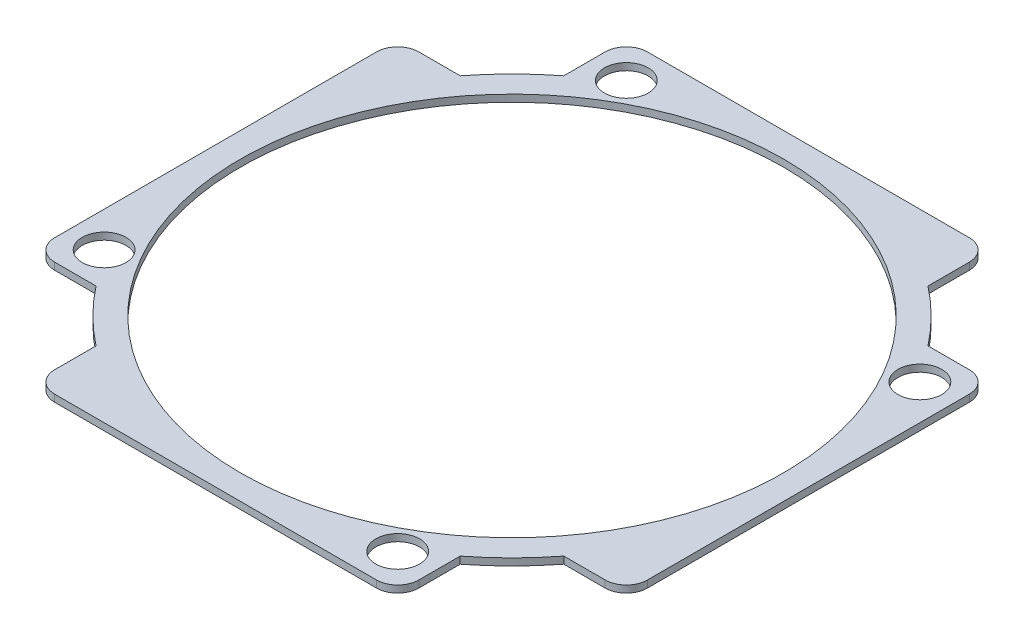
from build123d import *

# Parameters (mm, degrees)
SKETCH1_R           = 1.55
SKETCH1_R_2         = 19.25
BOSS_EXTRUDE1_DEPTH = 0.5


with BuildPart() as part:
    # Sketch1 → Boss-Extrude1 (new body)
    with BuildSketch(Plane(origin=(0, 0.5, 0), x_dir=(-1, 0, 0), z_dir=(0, 1, 0))):
        with BuildLine():
            Line((11.4, 21), (-11.4, 21))
            ThreePointArc((-11.4, 21), (-12.460660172, 20.560660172), (-12.9, 19.5))
            Line((-12.9, 19.5), (-12.9, 16.570757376))
            ThreePointArc((-12.9, 16.570757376), (-14.849242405, 14.849242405), (-16.570757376, 12.9))
            Line((-16.570757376, 12.9), (-19.5, 12.9))
            ThreePointArc((-19.5, 12.9), (-20.560660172, 12.460660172), (-21, 11.4))
            Line((-21, 11.4), (-21, -11.4))
            ThreePointArc((-21, -11.4), (-20.560660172, -12.460660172), (-19.5, -12.9))
            Line((-19.5, -12.9), (-16.570757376, -12.9))
            ThreePointArc((-16.570757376, -12.9), (-14.849242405, -14.849242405), (-12.9, -16.570757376))
            Line((-12.9, -16.570757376), (-12.9, -19.5))
            ThreePointArc((-12.9, -19.5), (-12.460660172, -20.560660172), (-11.4, -21))
            Line((-11.4, -21), (11.4, -21))
            ThreePointArc((11.4, -21), (12.460660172, -20.560660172), (12.9, -19.5))
            Line((12.9, -19.5), (12.9, -16.570757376))
            ThreePointArc((12.9, -16.570757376), (14.849242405, -14.849242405), (16.570757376, -12.9))
            Line((16.570757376, -12.9), (19.5, -12.9))
            ThreePointArc((19.5, -12.9), (20.560660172, -12.460660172), (21, -11.4))
            Line((21, -11.4), (21, 11.4))
            ThreePointArc((21, 11.4), (20.560660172, 12.460660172), (19.5, 12.9))
            Line((19.5, 12.9), (16.570757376, 12.9))
            ThreePointArc((16.570757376, 12.9), (14.849242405, 14.849242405), (12.9, 16.570757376))
            Line((12.9, 16.570757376), (12.9, 19.5))
            ThreePointArc((12.9, 19.5), (12.460660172, 20.560660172), (11.4, 21))
        make_face()
        with Locations(Location((-18.5, -10.4, 0), (0, 0, 270))):
            Circle(SKETCH1_R, mode=Mode.SUBTRACT)
        with Locations(Location((-10.4, 18.5, 0), (0, 0, 270))):
            Circle(SKETCH1_R, mode=Mode.SUBTRACT)
        with Locations(Location((18.5, 10.4, 0), (0, 0, 270))):
            Circle(SKETCH1_R, mode=Mode.SUBTRACT)
        with Locations(Location((10.4, -18.5, 0), (0, 0, 270))):
            Circle(SKETCH1_R, mode=Mode.SUBTRACT)
        with Locations(Location((0, 0, 0), (0, 0, 270))):
            Circle(SKETCH1_R_2, mode=Mode.SUBTRACT)
    extrude(amount=-BOSS_EXTRUDE1_DEPTH)


solid = part.part
